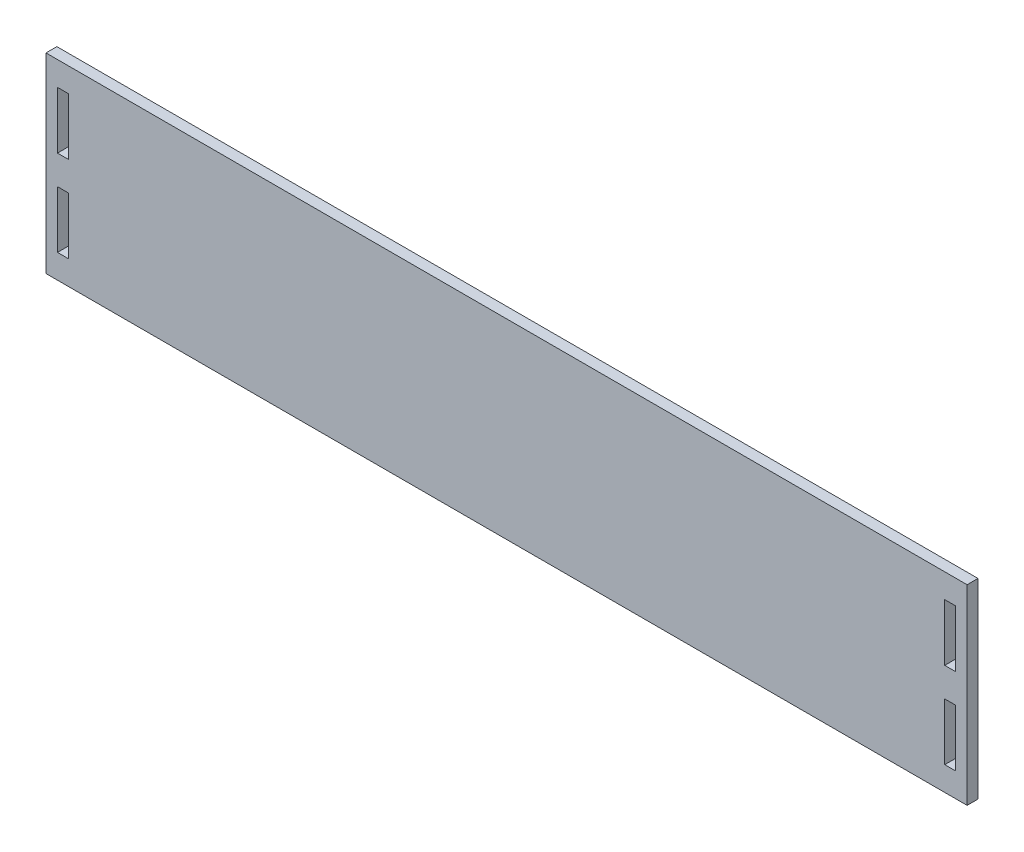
ISO-10303-21;
HEADER;
FILE_DESCRIPTION(('STEP AP214'),'2;1');
FILE_NAME('part.step','',(''),(''),'','','');
FILE_SCHEMA(('AUTOMOTIVE_DESIGN { 1 0 10303 214 1 1 1 1 }'));
ENDSEC;
DATA;
#1=APPLICATION_CONTEXT('core data for automotive mechanical design processes');
#2=APPLICATION_PROTOCOL_DEFINITION('international standard','automotive_design',2000,#1);
#3=PRODUCT_CONTEXT('',#1,'mechanical');
#4=PRODUCT('Part','Part','',(#3));
#5=PRODUCT_RELATED_PRODUCT_CATEGORY('part','',(#4));
#6=PRODUCT_DEFINITION_FORMATION('','',#4);
#7=PRODUCT_DEFINITION_CONTEXT('part definition',#1,'design');
#8=PRODUCT_DEFINITION('design','',#6,#7);
#9=PRODUCT_DEFINITION_SHAPE('','',#8);
#10=(LENGTH_UNIT() NAMED_UNIT(*) SI_UNIT(.MILLI.,.METRE.));
#11=(NAMED_UNIT(*) PLANE_ANGLE_UNIT() SI_UNIT($,.RADIAN.));
#12=(NAMED_UNIT(*) SI_UNIT($,.STERADIAN.) SOLID_ANGLE_UNIT());
#13=UNCERTAINTY_MEASURE_WITH_UNIT(LENGTH_MEASURE(1.E-05),#10,'distance_accuracy_value','');
#14=(GEOMETRIC_REPRESENTATION_CONTEXT(3) GLOBAL_UNCERTAINTY_ASSIGNED_CONTEXT((#13)) GLOBAL_UNIT_ASSIGNED_CONTEXT((#10,
#11,#12)) REPRESENTATION_CONTEXT('',''));
#15=CARTESIAN_POINT('',(0.,0.,0.));
#16=DIRECTION('',(0.,0.,1.));
#17=DIRECTION('',(1.,0.,0.));
#18=AXIS2_PLACEMENT_3D('',#15,#16,#17);
#19=CARTESIAN_POINT('',(241.,-50.,5.7));
#20=DIRECTION('',(-1.,0.,0.));
#21=DIRECTION('',(0.,0.,1.));
#22=AXIS2_PLACEMENT_3D('',#19,#20,#21);
#23=PLANE('',#22);
#24=DIRECTION('',(0.,1.,0.));
#25=VECTOR('',#24,1.);
#26=CARTESIAN_POINT('',(241.,-50.,0.));
#27=LINE('',#26,#25);
#28=CARTESIAN_POINT('',(241.,-50.,0.));
#29=VERTEX_POINT('',#28);
#30=CARTESIAN_POINT('',(241.,50.,0.));
#31=VERTEX_POINT('',#30);
#32=EDGE_CURVE('E301',#29,#31,#27,.T.);
#33=ORIENTED_EDGE('',*,*,#32,.T.);
#34=DIRECTION('',(0.,0.,-1.));
#35=VECTOR('',#34,1.);
#36=CARTESIAN_POINT('',(241.,50.,5.7));
#37=LINE('',#36,#35);
#38=CARTESIAN_POINT('',(241.,50.,5.7));
#39=VERTEX_POINT('',#38);
#40=EDGE_CURVE('E11',#39,#31,#37,.T.);
#41=ORIENTED_EDGE('',*,*,#40,.F.);
#42=DIRECTION('',(0.,1.,0.));
#43=VECTOR('',#42,1.);
#44=CARTESIAN_POINT('',(241.,-50.,5.7));
#45=LINE('',#44,#43);
#46=CARTESIAN_POINT('',(241.,-50.,5.7));
#47=VERTEX_POINT('',#46);
#48=EDGE_CURVE('E302',#47,#39,#45,.T.);
#49=ORIENTED_EDGE('',*,*,#48,.F.);
#50=DIRECTION('',(0.,0.,-1.));
#51=VECTOR('',#50,1.);
#52=CARTESIAN_POINT('',(241.,-50.,5.7));
#53=LINE('',#52,#51);
#54=EDGE_CURVE('E312',#47,#29,#53,.T.);
#55=ORIENTED_EDGE('',*,*,#54,.T.);
#56=EDGE_LOOP('',(#33,#41,#49,#55));
#57=FACE_BOUND('',#56,.T.);
#58=ADVANCED_FACE('F32',(#57),#23,.F.);
#59=CARTESIAN_POINT('',(-241.,50.,5.7));
#60=DIRECTION('',(0.,-1.,0.));
#61=DIRECTION('',(0.,0.,-1.));
#62=AXIS2_PLACEMENT_3D('',#59,#60,#61);
#63=PLANE('',#62);
#64=DIRECTION('',(-1.,0.,0.));
#65=VECTOR('',#64,1.);
#66=CARTESIAN_POINT('',(-241.,50.,0.));
#67=LINE('',#66,#65);
#68=CARTESIAN_POINT('',(-241.,50.,0.));
#69=VERTEX_POINT('',#68);
#70=EDGE_CURVE('E315',#31,#69,#67,.T.);
#71=ORIENTED_EDGE('',*,*,#70,.T.);
#72=DIRECTION('',(0.,0.,-1.));
#73=VECTOR('',#72,1.);
#74=CARTESIAN_POINT('',(-241.,50.,5.7));
#75=LINE('',#74,#73);
#76=CARTESIAN_POINT('',(-241.,50.,5.7));
#77=VERTEX_POINT('',#76);
#78=EDGE_CURVE('E39',#77,#69,#75,.T.);
#79=ORIENTED_EDGE('',*,*,#78,.F.);
#80=DIRECTION('',(-1.,0.,0.));
#81=VECTOR('',#80,1.);
#82=CARTESIAN_POINT('',(-241.,50.,5.7));
#83=LINE('',#82,#81);
#84=EDGE_CURVE('E305',#39,#77,#83,.T.);
#85=ORIENTED_EDGE('',*,*,#84,.F.);
#86=ORIENTED_EDGE('',*,*,#40,.T.);
#87=EDGE_LOOP('',(#71,#79,#85,#86));
#88=FACE_BOUND('',#87,.T.);
#89=ADVANCED_FACE('F344',(#88),#63,.F.);
#90=CARTESIAN_POINT('',(-241.,-50.,5.7));
#91=DIRECTION('',(1.,0.,0.));
#92=DIRECTION('',(0.,0.,-1.));
#93=AXIS2_PLACEMENT_3D('',#90,#91,#92);
#94=PLANE('',#93);
#95=DIRECTION('',(0.,-1.,0.));
#96=VECTOR('',#95,1.);
#97=CARTESIAN_POINT('',(-241.,-50.,0.));
#98=LINE('',#97,#96);
#99=CARTESIAN_POINT('',(-241.,-50.,0.));
#100=VERTEX_POINT('',#99);
#101=EDGE_CURVE('E317',#69,#100,#98,.T.);
#102=ORIENTED_EDGE('',*,*,#101,.T.);
#103=DIRECTION('',(0.,0.,-1.));
#104=VECTOR('',#103,1.);
#105=CARTESIAN_POINT('',(-241.,-50.,5.7));
#106=LINE('',#105,#104);
#107=CARTESIAN_POINT('',(-241.,-50.,5.7));
#108=VERTEX_POINT('',#107);
#109=EDGE_CURVE('E322',#108,#100,#106,.T.);
#110=ORIENTED_EDGE('',*,*,#109,.F.);
#111=DIRECTION('',(0.,-1.,0.));
#112=VECTOR('',#111,1.);
#113=CARTESIAN_POINT('',(-241.,-50.,5.7));
#114=LINE('',#113,#112);
#115=EDGE_CURVE('E308',#77,#108,#114,.T.);
#116=ORIENTED_EDGE('',*,*,#115,.F.);
#117=ORIENTED_EDGE('',*,*,#78,.T.);
#118=EDGE_LOOP('',(#102,#110,#116,#117));
#119=FACE_BOUND('',#118,.T.);
#120=ADVANCED_FACE('F329',(#119),#94,.F.);
#121=CARTESIAN_POINT('',(-241.,-50.,5.7));
#122=DIRECTION('',(0.,1.,0.));
#123=DIRECTION('',(0.,0.,1.));
#124=AXIS2_PLACEMENT_3D('',#121,#122,#123);
#125=PLANE('',#124);
#126=DIRECTION('',(1.,0.,0.));
#127=VECTOR('',#126,1.);
#128=CARTESIAN_POINT('',(-241.,-50.,0.));
#129=LINE('',#128,#127);
#130=EDGE_CURVE('E306',#100,#29,#129,.T.);
#131=ORIENTED_EDGE('',*,*,#130,.T.);
#132=ORIENTED_EDGE('',*,*,#54,.F.);
#133=DIRECTION('',(1.,0.,0.));
#134=VECTOR('',#133,1.);
#135=CARTESIAN_POINT('',(-241.,-50.,5.7));
#136=LINE('',#135,#134);
#137=EDGE_CURVE('E310',#108,#47,#136,.T.);
#138=ORIENTED_EDGE('',*,*,#137,.F.);
#139=ORIENTED_EDGE('',*,*,#109,.T.);
#140=EDGE_LOOP('',(#131,#132,#138,#139));
#141=FACE_BOUND('',#140,.T.);
#142=ADVANCED_FACE('F337',(#141),#125,.F.);
#143=CARTESIAN_POINT('',(0.,0.,5.7));
#144=DIRECTION('',(0.,0.,-1.));
#145=DIRECTION('',(-1.,0.,0.));
#146=AXIS2_PLACEMENT_3D('',#143,#144,#145);
#147=PLANE('',#146);
#148=DIRECTION('',(-1.,0.,0.));
#149=VECTOR('',#148,1.);
#150=CARTESIAN_POINT('',(-229.3,-7.60000000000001,5.7));
#151=LINE('',#150,#149);
#152=CARTESIAN_POINT('',(-229.3,-7.60000000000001,5.7));
#153=VERTEX_POINT('',#152);
#154=CARTESIAN_POINT('',(-235.,-7.60000000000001,5.7));
#155=VERTEX_POINT('',#154);
#156=EDGE_CURVE('E192',#153,#155,#151,.T.);
#157=ORIENTED_EDGE('',*,*,#156,.F.);
#158=DIRECTION('',(0.,1.,0.));
#159=VECTOR('',#158,1.);
#160=CARTESIAN_POINT('',(-229.3,-7.60000000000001,5.7));
#161=LINE('',#160,#159);
#162=CARTESIAN_POINT('',(-229.3,-37.4,5.7));
#163=VERTEX_POINT('',#162);
#164=EDGE_CURVE('E46',#163,#153,#161,.T.);
#165=ORIENTED_EDGE('',*,*,#164,.F.);
#166=DIRECTION('',(1.,0.,0.));
#167=VECTOR('',#166,1.);
#168=CARTESIAN_POINT('',(-229.3,-37.4,5.7));
#169=LINE('',#168,#167);
#170=CARTESIAN_POINT('',(-235.,-37.4,5.7));
#171=VERTEX_POINT('',#170);
#172=EDGE_CURVE('E185',#171,#163,#169,.T.);
#173=ORIENTED_EDGE('',*,*,#172,.F.);
#174=DIRECTION('',(0.,-1.,0.));
#175=VECTOR('',#174,1.);
#176=CARTESIAN_POINT('',(-235.,-7.60000000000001,5.7));
#177=LINE('',#176,#175);
#178=EDGE_CURVE('E199',#155,#171,#177,.T.);
#179=ORIENTED_EDGE('',*,*,#178,.F.);
#180=EDGE_LOOP('',(#157,#165,#173,#179));
#181=FACE_BOUND('',#180,.T.);
#182=DIRECTION('',(0.,-1.,0.));
#183=VECTOR('',#182,1.);
#184=CARTESIAN_POINT('',(229.3,-7.60000000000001,5.7));
#185=LINE('',#184,#183);
#186=CARTESIAN_POINT('',(229.3,-7.60000000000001,5.7));
#187=VERTEX_POINT('',#186);
#188=CARTESIAN_POINT('',(229.3,-37.4,5.7));
#189=VERTEX_POINT('',#188);
#190=EDGE_CURVE('E219',#187,#189,#185,.T.);
#191=ORIENTED_EDGE('',*,*,#190,.F.);
#192=DIRECTION('',(-1.,0.,0.));
#193=VECTOR('',#192,1.);
#194=CARTESIAN_POINT('',(229.3,-7.60000000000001,5.7));
#195=LINE('',#194,#193);
#196=CARTESIAN_POINT('',(235.,-7.60000000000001,5.7));
#197=VERTEX_POINT('',#196);
#198=EDGE_CURVE('E54',#197,#187,#195,.T.);
#199=ORIENTED_EDGE('',*,*,#198,.F.);
#200=DIRECTION('',(0.,1.,0.));
#201=VECTOR('',#200,1.);
#202=CARTESIAN_POINT('',(235.,-7.60000000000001,5.7));
#203=LINE('',#202,#201);
#204=CARTESIAN_POINT('',(235.,-37.4,5.7));
#205=VERTEX_POINT('',#204);
#206=EDGE_CURVE('E225',#205,#197,#203,.T.);
#207=ORIENTED_EDGE('',*,*,#206,.F.);
#208=DIRECTION('',(1.,0.,0.));
#209=VECTOR('',#208,1.);
#210=CARTESIAN_POINT('',(229.3,-37.4,5.7));
#211=LINE('',#210,#209);
#212=EDGE_CURVE('E222',#189,#205,#211,.T.);
#213=ORIENTED_EDGE('',*,*,#212,.F.);
#214=EDGE_LOOP('',(#191,#199,#207,#213));
#215=FACE_BOUND('',#214,.T.);
#216=DIRECTION('',(0.,-1.,0.));
#217=VECTOR('',#216,1.);
#218=CARTESIAN_POINT('',(229.3,37.4,5.7));
#219=LINE('',#218,#217);
#220=CARTESIAN_POINT('',(229.3,37.4,5.7));
#221=VERTEX_POINT('',#220);
#222=CARTESIAN_POINT('',(229.3,7.60000000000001,5.7));
#223=VERTEX_POINT('',#222);
#224=EDGE_CURVE('E250',#221,#223,#219,.T.);
#225=ORIENTED_EDGE('',*,*,#224,.F.);
#226=DIRECTION('',(-1.,0.,0.));
#227=VECTOR('',#226,1.);
#228=CARTESIAN_POINT('',(229.3,37.4,5.7));
#229=LINE('',#228,#227);
#230=CARTESIAN_POINT('',(235.,37.4,5.7));
#231=VERTEX_POINT('',#230);
#232=EDGE_CURVE('E248',#231,#221,#229,.T.);
#233=ORIENTED_EDGE('',*,*,#232,.F.);
#234=DIRECTION('',(0.,1.,0.));
#235=VECTOR('',#234,1.);
#236=CARTESIAN_POINT('',(235.,37.4,5.7));
#237=LINE('',#236,#235);
#238=CARTESIAN_POINT('',(235.,7.59999999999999,5.7));
#239=VERTEX_POINT('',#238);
#240=EDGE_CURVE('E256',#239,#231,#237,.T.);
#241=ORIENTED_EDGE('',*,*,#240,.F.);
#242=DIRECTION('',(1.,0.,0.));
#243=VECTOR('',#242,1.);
#244=CARTESIAN_POINT('',(229.3,7.60000000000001,5.7));
#245=LINE('',#244,#243);
#246=EDGE_CURVE('E253',#223,#239,#245,.T.);
#247=ORIENTED_EDGE('',*,*,#246,.F.);
#248=EDGE_LOOP('',(#225,#233,#241,#247));
#249=FACE_BOUND('',#248,.T.);
#250=DIRECTION('',(-1.,0.,0.));
#251=VECTOR('',#250,1.);
#252=CARTESIAN_POINT('',(-229.3,37.4,5.7));
#253=LINE('',#252,#251);
#254=CARTESIAN_POINT('',(-229.3,37.4,5.7));
#255=VERTEX_POINT('',#254);
#256=CARTESIAN_POINT('',(-235.,37.4,5.7));
#257=VERTEX_POINT('',#256);
#258=EDGE_CURVE('E280',#255,#257,#253,.T.);
#259=ORIENTED_EDGE('',*,*,#258,.F.);
#260=DIRECTION('',(0.,1.,0.));
#261=VECTOR('',#260,1.);
#262=CARTESIAN_POINT('',(-229.3,37.4,5.7));
#263=LINE('',#262,#261);
#264=CARTESIAN_POINT('',(-229.3,7.60000000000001,5.7));
#265=VERTEX_POINT('',#264);
#266=EDGE_CURVE('E278',#265,#255,#263,.T.);
#267=ORIENTED_EDGE('',*,*,#266,.F.);
#268=DIRECTION('',(1.,0.,0.));
#269=VECTOR('',#268,1.);
#270=CARTESIAN_POINT('',(-229.3,7.60000000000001,5.7));
#271=LINE('',#270,#269);
#272=CARTESIAN_POINT('',(-235.,7.59999999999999,5.7));
#273=VERTEX_POINT('',#272);
#274=EDGE_CURVE('E286',#273,#265,#271,.T.);
#275=ORIENTED_EDGE('',*,*,#274,.F.);
#276=DIRECTION('',(0.,-1.,0.));
#277=VECTOR('',#276,1.);
#278=CARTESIAN_POINT('',(-235.,37.4,5.7));
#279=LINE('',#278,#277);
#280=EDGE_CURVE('E283',#257,#273,#279,.T.);
#281=ORIENTED_EDGE('',*,*,#280,.F.);
#282=EDGE_LOOP('',(#259,#267,#275,#281));
#283=FACE_BOUND('',#282,.T.);
#284=ORIENTED_EDGE('',*,*,#48,.T.);
#285=ORIENTED_EDGE('',*,*,#84,.T.);
#286=ORIENTED_EDGE('',*,*,#115,.T.);
#287=ORIENTED_EDGE('',*,*,#137,.T.);
#288=EDGE_LOOP('',(#284,#285,#286,#287));
#289=FACE_BOUND('',#288,.T.);
#290=ADVANCED_FACE('F343',(#181,#215,#249,#283,#289),#147,.F.);
#291=CARTESIAN_POINT('',(0.,0.,0.));
#292=DIRECTION('',(0.,0.,-1.));
#293=DIRECTION('',(-1.,0.,0.));
#294=AXIS2_PLACEMENT_3D('',#291,#292,#293);
#295=PLANE('',#294);
#296=DIRECTION('',(0.,1.,0.));
#297=VECTOR('',#296,1.);
#298=CARTESIAN_POINT('',(-229.3,-7.60000000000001,0.));
#299=LINE('',#298,#297);
#300=CARTESIAN_POINT('',(-229.3,-37.4,0.));
#301=VERTEX_POINT('',#300);
#302=CARTESIAN_POINT('',(-229.3,-7.60000000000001,0.));
#303=VERTEX_POINT('',#302);
#304=EDGE_CURVE('E183',#301,#303,#299,.T.);
#305=ORIENTED_EDGE('',*,*,#304,.T.);
#306=DIRECTION('',(-1.,0.,0.));
#307=VECTOR('',#306,1.);
#308=CARTESIAN_POINT('',(-229.3,-7.60000000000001,0.));
#309=LINE('',#308,#307);
#310=CARTESIAN_POINT('',(-235.,-7.60000000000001,0.));
#311=VERTEX_POINT('',#310);
#312=EDGE_CURVE('E169',#303,#311,#309,.T.);
#313=ORIENTED_EDGE('',*,*,#312,.T.);
#314=DIRECTION('',(0.,-1.,0.));
#315=VECTOR('',#314,1.);
#316=CARTESIAN_POINT('',(-235.,-7.60000000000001,0.));
#317=LINE('',#316,#315);
#318=CARTESIAN_POINT('',(-235.,-37.4,0.));
#319=VERTEX_POINT('',#318);
#320=EDGE_CURVE('E194',#311,#319,#317,.T.);
#321=ORIENTED_EDGE('',*,*,#320,.T.);
#322=DIRECTION('',(1.,0.,0.));
#323=VECTOR('',#322,1.);
#324=CARTESIAN_POINT('',(-229.3,-37.4,0.));
#325=LINE('',#324,#323);
#326=EDGE_CURVE('E190',#319,#301,#325,.T.);
#327=ORIENTED_EDGE('',*,*,#326,.T.);
#328=EDGE_LOOP('',(#305,#313,#321,#327));
#329=FACE_BOUND('',#328,.T.);
#330=DIRECTION('',(-1.,0.,0.));
#331=VECTOR('',#330,1.);
#332=CARTESIAN_POINT('',(229.3,-7.60000000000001,0.));
#333=LINE('',#332,#331);
#334=CARTESIAN_POINT('',(235.,-7.60000000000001,0.));
#335=VERTEX_POINT('',#334);
#336=CARTESIAN_POINT('',(229.3,-7.60000000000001,0.));
#337=VERTEX_POINT('',#336);
#338=EDGE_CURVE('E215',#335,#337,#333,.T.);
#339=ORIENTED_EDGE('',*,*,#338,.T.);
#340=DIRECTION('',(0.,-1.,0.));
#341=VECTOR('',#340,1.);
#342=CARTESIAN_POINT('',(229.3,-7.60000000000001,0.));
#343=LINE('',#342,#341);
#344=CARTESIAN_POINT('',(229.3,-37.4,0.));
#345=VERTEX_POINT('',#344);
#346=EDGE_CURVE('E231',#337,#345,#343,.T.);
#347=ORIENTED_EDGE('',*,*,#346,.T.);
#348=DIRECTION('',(1.,0.,0.));
#349=VECTOR('',#348,1.);
#350=CARTESIAN_POINT('',(229.3,-37.4,0.));
#351=LINE('',#350,#349);
#352=CARTESIAN_POINT('',(235.,-37.4,0.));
#353=VERTEX_POINT('',#352);
#354=EDGE_CURVE('E208',#345,#353,#351,.T.);
#355=ORIENTED_EDGE('',*,*,#354,.T.);
#356=DIRECTION('',(0.,1.,0.));
#357=VECTOR('',#356,1.);
#358=CARTESIAN_POINT('',(235.,-7.60000000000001,0.));
#359=LINE('',#358,#357);
#360=EDGE_CURVE('E211',#353,#335,#359,.T.);
#361=ORIENTED_EDGE('',*,*,#360,.T.);
#362=EDGE_LOOP('',(#339,#347,#355,#361));
#363=FACE_BOUND('',#362,.T.);
#364=DIRECTION('',(-1.,0.,0.));
#365=VECTOR('',#364,1.);
#366=CARTESIAN_POINT('',(229.3,37.4,0.));
#367=LINE('',#366,#365);
#368=CARTESIAN_POINT('',(235.,37.4,0.));
#369=VERTEX_POINT('',#368);
#370=CARTESIAN_POINT('',(229.3,37.4,0.));
#371=VERTEX_POINT('',#370);
#372=EDGE_CURVE('E245',#369,#371,#367,.T.);
#373=ORIENTED_EDGE('',*,*,#372,.T.);
#374=DIRECTION('',(0.,-1.,0.));
#375=VECTOR('',#374,1.);
#376=CARTESIAN_POINT('',(229.3,37.4,0.));
#377=LINE('',#376,#375);
#378=CARTESIAN_POINT('',(229.3,7.60000000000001,0.));
#379=VERTEX_POINT('',#378);
#380=EDGE_CURVE('E212',#371,#379,#377,.T.);
#381=ORIENTED_EDGE('',*,*,#380,.T.);
#382=DIRECTION('',(1.,0.,0.));
#383=VECTOR('',#382,1.);
#384=CARTESIAN_POINT('',(229.3,7.60000000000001,0.));
#385=LINE('',#384,#383);
#386=CARTESIAN_POINT('',(235.,7.59999999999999,0.));
#387=VERTEX_POINT('',#386);
#388=EDGE_CURVE('E239',#379,#387,#385,.T.);
#389=ORIENTED_EDGE('',*,*,#388,.T.);
#390=DIRECTION('',(0.,1.,0.));
#391=VECTOR('',#390,1.);
#392=CARTESIAN_POINT('',(235.,37.4,0.));
#393=LINE('',#392,#391);
#394=EDGE_CURVE('E242',#387,#369,#393,.T.);
#395=ORIENTED_EDGE('',*,*,#394,.T.);
#396=EDGE_LOOP('',(#373,#381,#389,#395));
#397=FACE_BOUND('',#396,.T.);
#398=DIRECTION('',(0.,1.,0.));
#399=VECTOR('',#398,1.);
#400=CARTESIAN_POINT('',(-229.3,37.4,0.));
#401=LINE('',#400,#399);
#402=CARTESIAN_POINT('',(-229.3,7.60000000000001,0.));
#403=VERTEX_POINT('',#402);
#404=CARTESIAN_POINT('',(-229.3,37.4,0.));
#405=VERTEX_POINT('',#404);
#406=EDGE_CURVE('E275',#403,#405,#401,.T.);
#407=ORIENTED_EDGE('',*,*,#406,.T.);
#408=DIRECTION('',(-1.,0.,0.));
#409=VECTOR('',#408,1.);
#410=CARTESIAN_POINT('',(-229.3,37.4,0.));
#411=LINE('',#410,#409);
#412=CARTESIAN_POINT('',(-235.,37.4,0.));
#413=VERTEX_POINT('',#412);
#414=EDGE_CURVE('E292',#405,#413,#411,.T.);
#415=ORIENTED_EDGE('',*,*,#414,.T.);
#416=DIRECTION('',(0.,-1.,0.));
#417=VECTOR('',#416,1.);
#418=CARTESIAN_POINT('',(-235.,37.4,0.));
#419=LINE('',#418,#417);
#420=CARTESIAN_POINT('',(-235.,7.59999999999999,0.));
#421=VERTEX_POINT('',#420);
#422=EDGE_CURVE('E179',#413,#421,#419,.T.);
#423=ORIENTED_EDGE('',*,*,#422,.T.);
#424=DIRECTION('',(1.,0.,0.));
#425=VECTOR('',#424,1.);
#426=CARTESIAN_POINT('',(-229.3,7.60000000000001,0.));
#427=LINE('',#426,#425);
#428=EDGE_CURVE('E272',#421,#403,#427,.T.);
#429=ORIENTED_EDGE('',*,*,#428,.T.);
#430=EDGE_LOOP('',(#407,#415,#423,#429));
#431=FACE_BOUND('',#430,.T.);
#432=ORIENTED_EDGE('',*,*,#32,.F.);
#433=ORIENTED_EDGE('',*,*,#130,.F.);
#434=ORIENTED_EDGE('',*,*,#101,.F.);
#435=ORIENTED_EDGE('',*,*,#70,.F.);
#436=EDGE_LOOP('',(#432,#433,#434,#435));
#437=FACE_BOUND('',#436,.T.);
#438=ADVANCED_FACE('F188',(#329,#363,#397,#431,#437),#295,.T.);
#439=CARTESIAN_POINT('',(-229.3,37.4,-0.00100000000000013));
#440=DIRECTION('',(1.,0.,0.));
#441=DIRECTION('',(0.,0.,-1.));
#442=AXIS2_PLACEMENT_3D('',#439,#440,#441);
#443=PLANE('',#442);
#444=DIRECTION('',(0.,0.,1.));
#445=VECTOR('',#444,1.);
#446=CARTESIAN_POINT('',(-229.3,7.60000000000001,-0.00100000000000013));
#447=LINE('',#446,#445);
#448=EDGE_CURVE('E290',#403,#265,#447,.T.);
#449=ORIENTED_EDGE('',*,*,#448,.T.);
#450=ORIENTED_EDGE('',*,*,#266,.T.);
#451=DIRECTION('',(0.,0.,1.));
#452=VECTOR('',#451,1.);
#453=CARTESIAN_POINT('',(-229.3,37.4,-0.00100000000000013));
#454=LINE('',#453,#452);
#455=EDGE_CURVE('E289',#405,#255,#454,.T.);
#456=ORIENTED_EDGE('',*,*,#455,.F.);
#457=ORIENTED_EDGE('',*,*,#406,.F.);
#458=EDGE_LOOP('',(#449,#450,#456,#457));
#459=FACE_BOUND('',#458,.T.);
#460=ADVANCED_FACE('F356',(#459),#443,.F.);
#461=CARTESIAN_POINT('',(-229.3,7.60000000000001,-0.00100000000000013));
#462=DIRECTION('',(0.,-1.,0.));
#463=DIRECTION('',(1.,0.,0.));
#464=AXIS2_PLACEMENT_3D('',#461,#462,#463);
#465=PLANE('',#464);
#466=DIRECTION('',(0.,0.,1.));
#467=VECTOR('',#466,1.);
#468=CARTESIAN_POINT('',(-235.,7.59999999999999,-0.00100000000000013));
#469=LINE('',#468,#467);
#470=EDGE_CURVE('E293',#421,#273,#469,.T.);
#471=ORIENTED_EDGE('',*,*,#470,.T.);
#472=ORIENTED_EDGE('',*,*,#274,.T.);
#473=ORIENTED_EDGE('',*,*,#448,.F.);
#474=ORIENTED_EDGE('',*,*,#428,.F.);
#475=EDGE_LOOP('',(#471,#472,#473,#474));
#476=FACE_BOUND('',#475,.T.);
#477=ADVANCED_FACE('F362',(#476),#465,.F.);
#478=CARTESIAN_POINT('',(-235.,37.4,-0.00100000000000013));
#479=DIRECTION('',(-1.,0.,0.));
#480=DIRECTION('',(0.,0.,1.));
#481=AXIS2_PLACEMENT_3D('',#478,#479,#480);
#482=PLANE('',#481);
#483=DIRECTION('',(0.,0.,1.));
#484=VECTOR('',#483,1.);
#485=CARTESIAN_POINT('',(-235.,37.4,-0.00100000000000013));
#486=LINE('',#485,#484);
#487=EDGE_CURVE('E295',#413,#257,#486,.T.);
#488=ORIENTED_EDGE('',*,*,#487,.T.);
#489=ORIENTED_EDGE('',*,*,#280,.T.);
#490=ORIENTED_EDGE('',*,*,#470,.F.);
#491=ORIENTED_EDGE('',*,*,#422,.F.);
#492=EDGE_LOOP('',(#488,#489,#490,#491));
#493=FACE_BOUND('',#492,.T.);
#494=ADVANCED_FACE('F368',(#493),#482,.F.);
#495=CARTESIAN_POINT('',(-229.3,37.4,-0.00100000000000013));
#496=DIRECTION('',(0.,1.,0.));
#497=DIRECTION('',(-1.,0.,0.));
#498=AXIS2_PLACEMENT_3D('',#495,#496,#497);
#499=PLANE('',#498);
#500=ORIENTED_EDGE('',*,*,#455,.T.);
#501=ORIENTED_EDGE('',*,*,#258,.T.);
#502=ORIENTED_EDGE('',*,*,#487,.F.);
#503=ORIENTED_EDGE('',*,*,#414,.F.);
#504=EDGE_LOOP('',(#500,#501,#502,#503));
#505=FACE_BOUND('',#504,.T.);
#506=ADVANCED_FACE('F364',(#505),#499,.F.);
#507=CARTESIAN_POINT('',(229.3,37.4,-0.00100000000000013));
#508=DIRECTION('',(0.,1.,0.));
#509=DIRECTION('',(-1.,0.,0.));
#510=AXIS2_PLACEMENT_3D('',#507,#508,#509);
#511=PLANE('',#510);
#512=DIRECTION('',(0.,0.,1.));
#513=VECTOR('',#512,1.);
#514=CARTESIAN_POINT('',(235.,37.4,-0.00100000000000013));
#515=LINE('',#514,#513);
#516=EDGE_CURVE('E260',#369,#231,#515,.T.);
#517=ORIENTED_EDGE('',*,*,#516,.T.);
#518=ORIENTED_EDGE('',*,*,#232,.T.);
#519=DIRECTION('',(0.,0.,1.));
#520=VECTOR('',#519,1.);
#521=CARTESIAN_POINT('',(229.3,37.4,-0.00100000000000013));
#522=LINE('',#521,#520);
#523=EDGE_CURVE('E259',#371,#221,#522,.T.);
#524=ORIENTED_EDGE('',*,*,#523,.F.);
#525=ORIENTED_EDGE('',*,*,#372,.F.);
#526=EDGE_LOOP('',(#517,#518,#524,#525));
#527=FACE_BOUND('',#526,.T.);
#528=ADVANCED_FACE('F367',(#527),#511,.F.);
#529=CARTESIAN_POINT('',(235.,37.4,-0.00100000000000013));
#530=DIRECTION('',(1.,0.,0.));
#531=DIRECTION('',(0.,0.,-1.));
#532=AXIS2_PLACEMENT_3D('',#529,#530,#531);
#533=PLANE('',#532);
#534=DIRECTION('',(0.,0.,1.));
#535=VECTOR('',#534,1.);
#536=CARTESIAN_POINT('',(235.,7.59999999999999,-0.00100000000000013));
#537=LINE('',#536,#535);
#538=EDGE_CURVE('E262',#387,#239,#537,.T.);
#539=ORIENTED_EDGE('',*,*,#538,.T.);
#540=ORIENTED_EDGE('',*,*,#240,.T.);
#541=ORIENTED_EDGE('',*,*,#516,.F.);
#542=ORIENTED_EDGE('',*,*,#394,.F.);
#543=EDGE_LOOP('',(#539,#540,#541,#542));
#544=FACE_BOUND('',#543,.T.);
#545=ADVANCED_FACE('F378',(#544),#533,.F.);
#546=CARTESIAN_POINT('',(229.3,7.60000000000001,-0.00100000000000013));
#547=DIRECTION('',(0.,-1.,0.));
#548=DIRECTION('',(1.,0.,0.));
#549=AXIS2_PLACEMENT_3D('',#546,#547,#548);
#550=PLANE('',#549);
#551=DIRECTION('',(0.,0.,1.));
#552=VECTOR('',#551,1.);
#553=CARTESIAN_POINT('',(229.3,7.60000000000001,-0.00100000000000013));
#554=LINE('',#553,#552);
#555=EDGE_CURVE('E264',#379,#223,#554,.T.);
#556=ORIENTED_EDGE('',*,*,#555,.T.);
#557=ORIENTED_EDGE('',*,*,#246,.T.);
#558=ORIENTED_EDGE('',*,*,#538,.F.);
#559=ORIENTED_EDGE('',*,*,#388,.F.);
#560=EDGE_LOOP('',(#556,#557,#558,#559));
#561=FACE_BOUND('',#560,.T.);
#562=ADVANCED_FACE('F384',(#561),#550,.F.);
#563=CARTESIAN_POINT('',(229.3,37.4,-0.00100000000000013));
#564=DIRECTION('',(-1.,0.,0.));
#565=DIRECTION('',(0.,0.,1.));
#566=AXIS2_PLACEMENT_3D('',#563,#564,#565);
#567=PLANE('',#566);
#568=ORIENTED_EDGE('',*,*,#523,.T.);
#569=ORIENTED_EDGE('',*,*,#224,.T.);
#570=ORIENTED_EDGE('',*,*,#555,.F.);
#571=ORIENTED_EDGE('',*,*,#380,.F.);
#572=EDGE_LOOP('',(#568,#569,#570,#571));
#573=FACE_BOUND('',#572,.T.);
#574=ADVANCED_FACE('F380',(#573),#567,.F.);
#575=CARTESIAN_POINT('',(229.3,-7.60000000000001,-0.00100000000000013));
#576=DIRECTION('',(0.,1.,0.));
#577=DIRECTION('',(0.,0.,1.));
#578=AXIS2_PLACEMENT_3D('',#575,#576,#577);
#579=PLANE('',#578);
#580=DIRECTION('',(0.,0.,1.));
#581=VECTOR('',#580,1.);
#582=CARTESIAN_POINT('',(235.,-7.60000000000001,-0.00100000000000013));
#583=LINE('',#582,#581);
#584=EDGE_CURVE('E229',#335,#197,#583,.T.);
#585=ORIENTED_EDGE('',*,*,#584,.T.);
#586=ORIENTED_EDGE('',*,*,#198,.T.);
#587=DIRECTION('',(0.,0.,1.));
#588=VECTOR('',#587,1.);
#589=CARTESIAN_POINT('',(229.3,-7.60000000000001,-0.00100000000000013));
#590=LINE('',#589,#588);
#591=EDGE_CURVE('E228',#337,#187,#590,.T.);
#592=ORIENTED_EDGE('',*,*,#591,.F.);
#593=ORIENTED_EDGE('',*,*,#338,.F.);
#594=EDGE_LOOP('',(#585,#586,#592,#593));
#595=FACE_BOUND('',#594,.T.);
#596=ADVANCED_FACE('F383',(#595),#579,.F.);
#597=CARTESIAN_POINT('',(235.,-7.60000000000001,-0.00100000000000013));
#598=DIRECTION('',(1.,0.,0.));
#599=DIRECTION('',(0.,0.,-1.));
#600=AXIS2_PLACEMENT_3D('',#597,#598,#599);
#601=PLANE('',#600);
#602=DIRECTION('',(0.,0.,1.));
#603=VECTOR('',#602,1.);
#604=CARTESIAN_POINT('',(235.,-37.4,-0.00100000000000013));
#605=LINE('',#604,#603);
#606=EDGE_CURVE('E232',#353,#205,#605,.T.);
#607=ORIENTED_EDGE('',*,*,#606,.T.);
#608=ORIENTED_EDGE('',*,*,#206,.T.);
#609=ORIENTED_EDGE('',*,*,#584,.F.);
#610=ORIENTED_EDGE('',*,*,#360,.F.);
#611=EDGE_LOOP('',(#607,#608,#609,#610));
#612=FACE_BOUND('',#611,.T.);
#613=ADVANCED_FACE('F394',(#612),#601,.F.);
#614=CARTESIAN_POINT('',(229.3,-37.4,-0.00100000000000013));
#615=DIRECTION('',(0.,-1.,0.));
#616=DIRECTION('',(0.,0.,-1.));
#617=AXIS2_PLACEMENT_3D('',#614,#615,#616);
#618=PLANE('',#617);
#619=DIRECTION('',(0.,0.,1.));
#620=VECTOR('',#619,1.);
#621=CARTESIAN_POINT('',(229.3,-37.4,-0.00100000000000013));
#622=LINE('',#621,#620);
#623=EDGE_CURVE('E234',#345,#189,#622,.T.);
#624=ORIENTED_EDGE('',*,*,#623,.T.);
#625=ORIENTED_EDGE('',*,*,#212,.T.);
#626=ORIENTED_EDGE('',*,*,#606,.F.);
#627=ORIENTED_EDGE('',*,*,#354,.F.);
#628=EDGE_LOOP('',(#624,#625,#626,#627));
#629=FACE_BOUND('',#628,.T.);
#630=ADVANCED_FACE('F398',(#629),#618,.F.);
#631=CARTESIAN_POINT('',(229.3,-7.60000000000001,-0.00100000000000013));
#632=DIRECTION('',(-1.,0.,0.));
#633=DIRECTION('',(0.,0.,1.));
#634=AXIS2_PLACEMENT_3D('',#631,#632,#633);
#635=PLANE('',#634);
#636=ORIENTED_EDGE('',*,*,#591,.T.);
#637=ORIENTED_EDGE('',*,*,#190,.T.);
#638=ORIENTED_EDGE('',*,*,#623,.F.);
#639=ORIENTED_EDGE('',*,*,#346,.F.);
#640=EDGE_LOOP('',(#636,#637,#638,#639));
#641=FACE_BOUND('',#640,.T.);
#642=ADVANCED_FACE('F395',(#641),#635,.F.);
#643=CARTESIAN_POINT('',(-229.3,-7.60000000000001,-0.00100000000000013));
#644=DIRECTION('',(1.,0.,0.));
#645=DIRECTION('',(0.,0.,-1.));
#646=AXIS2_PLACEMENT_3D('',#643,#644,#645);
#647=PLANE('',#646);
#648=DIRECTION('',(0.,0.,1.));
#649=VECTOR('',#648,1.);
#650=CARTESIAN_POINT('',(-229.3,-37.4,-0.00100000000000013));
#651=LINE('',#650,#649);
#652=EDGE_CURVE('E180',#301,#163,#651,.T.);
#653=ORIENTED_EDGE('',*,*,#652,.T.);
#654=ORIENTED_EDGE('',*,*,#164,.T.);
#655=DIRECTION('',(0.,0.,1.));
#656=VECTOR('',#655,1.);
#657=CARTESIAN_POINT('',(-229.3,-7.60000000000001,-0.00100000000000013));
#658=LINE('',#657,#656);
#659=EDGE_CURVE('E172',#303,#153,#658,.T.);
#660=ORIENTED_EDGE('',*,*,#659,.F.);
#661=ORIENTED_EDGE('',*,*,#304,.F.);
#662=EDGE_LOOP('',(#653,#654,#660,#661));
#663=FACE_BOUND('',#662,.T.);
#664=ADVANCED_FACE('F182',(#663),#647,.F.);
#665=CARTESIAN_POINT('',(-229.3,-37.4,-0.00100000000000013));
#666=DIRECTION('',(0.,-1.,0.));
#667=DIRECTION('',(0.,0.,-1.));
#668=AXIS2_PLACEMENT_3D('',#665,#666,#667);
#669=PLANE('',#668);
#670=DIRECTION('',(0.,0.,1.));
#671=VECTOR('',#670,1.);
#672=CARTESIAN_POINT('',(-235.,-37.4,-0.00100000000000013));
#673=LINE('',#672,#671);
#674=EDGE_CURVE('E205',#319,#171,#673,.T.);
#675=ORIENTED_EDGE('',*,*,#674,.T.);
#676=ORIENTED_EDGE('',*,*,#172,.T.);
#677=ORIENTED_EDGE('',*,*,#652,.F.);
#678=ORIENTED_EDGE('',*,*,#326,.F.);
#679=EDGE_LOOP('',(#675,#676,#677,#678));
#680=FACE_BOUND('',#679,.T.);
#681=ADVANCED_FACE('F408',(#680),#669,.F.);
#682=CARTESIAN_POINT('',(-235.,-7.60000000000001,-0.00100000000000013));
#683=DIRECTION('',(-1.,0.,0.));
#684=DIRECTION('',(0.,0.,1.));
#685=AXIS2_PLACEMENT_3D('',#682,#683,#684);
#686=PLANE('',#685);
#687=DIRECTION('',(0.,0.,1.));
#688=VECTOR('',#687,1.);
#689=CARTESIAN_POINT('',(-235.,-7.60000000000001,-0.00100000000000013));
#690=LINE('',#689,#688);
#691=EDGE_CURVE('E174',#311,#155,#690,.T.);
#692=ORIENTED_EDGE('',*,*,#691,.T.);
#693=ORIENTED_EDGE('',*,*,#178,.T.);
#694=ORIENTED_EDGE('',*,*,#674,.F.);
#695=ORIENTED_EDGE('',*,*,#320,.F.);
#696=EDGE_LOOP('',(#692,#693,#694,#695));
#697=FACE_BOUND('',#696,.T.);
#698=ADVANCED_FACE('F411',(#697),#686,.F.);
#699=CARTESIAN_POINT('',(-229.3,-7.60000000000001,-0.00100000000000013));
#700=DIRECTION('',(0.,1.,0.));
#701=DIRECTION('',(0.,0.,1.));
#702=AXIS2_PLACEMENT_3D('',#699,#700,#701);
#703=PLANE('',#702);
#704=ORIENTED_EDGE('',*,*,#659,.T.);
#705=ORIENTED_EDGE('',*,*,#156,.T.);
#706=ORIENTED_EDGE('',*,*,#691,.F.);
#707=ORIENTED_EDGE('',*,*,#312,.F.);
#708=EDGE_LOOP('',(#704,#705,#706,#707));
#709=FACE_BOUND('',#708,.T.);
#710=ADVANCED_FACE('F170',(#709),#703,.F.);
#711=CLOSED_SHELL('',(#58,#89,#120,#142,#290,#438,#460,#477,#494,#506,#528,#545,#562,#574,#596,
#613,#630,#642,#664,#681,#698,#710));
#712=MANIFOLD_SOLID_BREP('B2',#711);
#713=ADVANCED_BREP_SHAPE_REPRESENTATION('',(#18,#712),#14);
#714=SHAPE_DEFINITION_REPRESENTATION(#9,#713);
ENDSEC;
END-ISO-10303-21;
